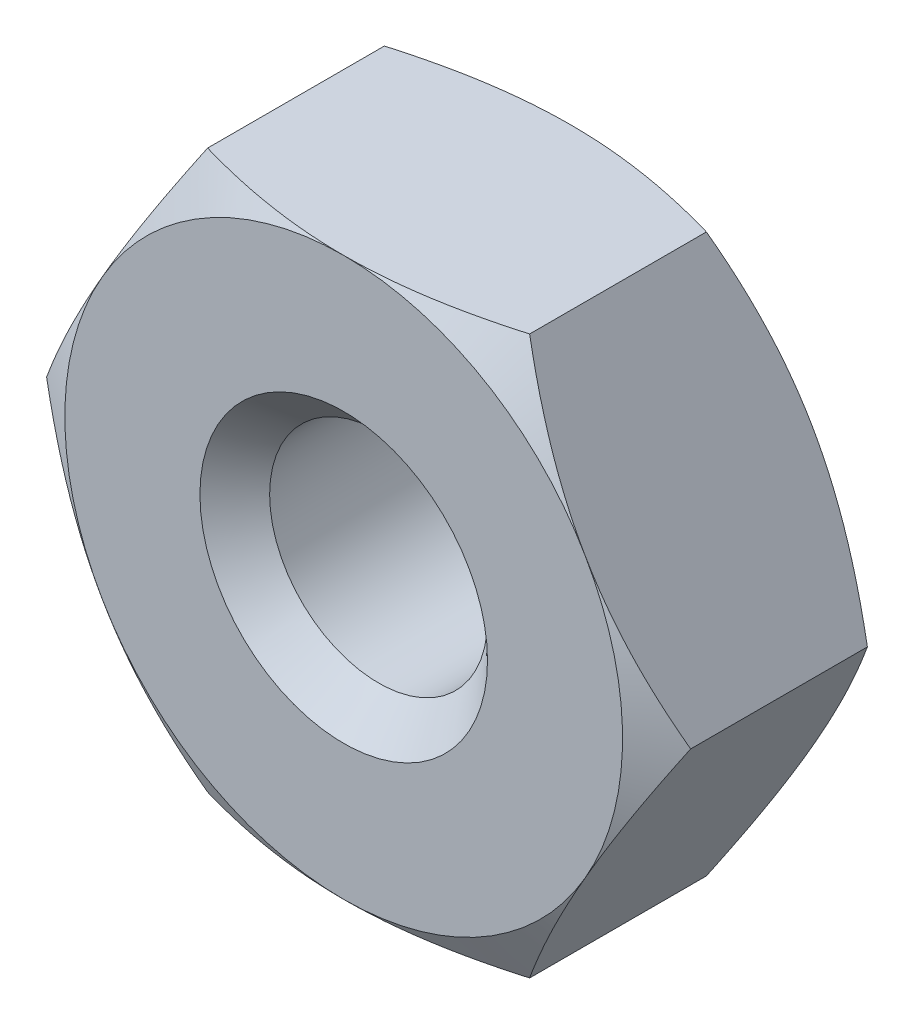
ISO-10303-21;
HEADER;
FILE_DESCRIPTION(('STEP AP214'),'2;1');
FILE_NAME('part.step','',(''),(''),'','','');
FILE_SCHEMA(('AUTOMOTIVE_DESIGN { 1 0 10303 214 1 1 1 1 }'));
ENDSEC;
DATA;
#1=APPLICATION_CONTEXT('core data for automotive mechanical design processes');
#2=APPLICATION_PROTOCOL_DEFINITION('international standard','automotive_design',2000,#1);
#3=PRODUCT_CONTEXT('',#1,'mechanical');
#4=PRODUCT('Part','Part','',(#3));
#5=PRODUCT_RELATED_PRODUCT_CATEGORY('part','',(#4));
#6=PRODUCT_DEFINITION_FORMATION('','',#4);
#7=PRODUCT_DEFINITION_CONTEXT('part definition',#1,'design');
#8=PRODUCT_DEFINITION('design','',#6,#7);
#9=PRODUCT_DEFINITION_SHAPE('','',#8);
#10=(LENGTH_UNIT() NAMED_UNIT(*) SI_UNIT(.MILLI.,.METRE.));
#11=(NAMED_UNIT(*) PLANE_ANGLE_UNIT() SI_UNIT($,.RADIAN.));
#12=(NAMED_UNIT(*) SI_UNIT($,.STERADIAN.) SOLID_ANGLE_UNIT());
#13=UNCERTAINTY_MEASURE_WITH_UNIT(LENGTH_MEASURE(1.E-05),#10,'distance_accuracy_value','');
#14=(GEOMETRIC_REPRESENTATION_CONTEXT(3) GLOBAL_UNCERTAINTY_ASSIGNED_CONTEXT((#13)) GLOBAL_UNIT_ASSIGNED_CONTEXT((#10,
#11,#12)) REPRESENTATION_CONTEXT('',''));
#15=CARTESIAN_POINT('',(0.,0.,0.));
#16=DIRECTION('',(0.,0.,1.));
#17=DIRECTION('',(1.,0.,0.));
#18=AXIS2_PLACEMENT_3D('',#15,#16,#17);
#19=CARTESIAN_POINT('',(1.8475208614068,0.,0.65));
#20=DIRECTION('',(-0.866025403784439,-0.5,0.));
#21=DIRECTION('',(0.5,-0.866025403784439,0.));
#22=AXIS2_PLACEMENT_3D('',#19,#20,#21);
#23=PLANE('',#22);
#24=DIRECTION('',(0.,0.,-1.));
#25=VECTOR('',#24,1.);
#26=CARTESIAN_POINT('',(1.8475208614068,0.,0.65));
#27=LINE('',#26,#25);
#28=CARTESIAN_POINT('',(1.8475208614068,0.,0.507093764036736));
#29=VERTEX_POINT('',#28);
#30=CARTESIAN_POINT('',(1.8475208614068,0.,-0.507093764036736));
#31=VERTEX_POINT('',#30);
#32=EDGE_CURVE('E157',#29,#31,#27,.T.);
#33=ORIENTED_EDGE('',*,*,#32,.T.);
#34=CARTESIAN_POINT('',(1.84763633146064,-0.000199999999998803,-0.50702709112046));
#35=CARTESIAN_POINT('',(1.8070407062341,0.0701136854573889,-0.530476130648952));
#36=CARTESIAN_POINT('',(1.76609466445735,0.14103431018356,-0.551802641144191));
#37=CARTESIAN_POINT('',(1.68349346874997,0.284103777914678,-0.589029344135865));
#38=CARTESIAN_POINT('',(1.64183684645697,0.356255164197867,-0.604916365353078));
#39=CARTESIAN_POINT('',(1.55903989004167,0.499663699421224,-0.629648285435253));
#40=CARTESIAN_POINT('',(1.51791229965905,0.570898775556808,-0.63865776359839));
#41=CARTESIAN_POINT('',(1.43546347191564,0.713704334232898,-0.649415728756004));
#42=CARTESIAN_POINT('',(1.3941425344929,0.785274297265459,-0.651173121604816));
#43=CARTESIAN_POINT('',(1.31692357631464,0.919021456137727,-0.647528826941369));
#44=CARTESIAN_POINT('',(1.28101403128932,0.981218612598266,-0.64302194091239));
#45=CARTESIAN_POINT('',(1.20942890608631,1.10520768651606,-0.628734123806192));
#46=CARTESIAN_POINT('',(1.1737535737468,1.166999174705,-0.618948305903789));
#47=CARTESIAN_POINT('',(1.10202069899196,1.29124415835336,-0.594483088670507));
#48=CARTESIAN_POINT('',(1.06597224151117,1.35368191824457,-0.579699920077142));
#49=CARTESIAN_POINT('',(0.994413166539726,1.47762587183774,-0.546147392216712));
#50=CARTESIAN_POINT('',(0.958901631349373,1.5391336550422,-0.527385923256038));
#51=CARTESIAN_POINT('',(0.923644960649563,1.6002,-0.50702709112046));
#52=B_SPLINE_CURVE_WITH_KNOTS('',3,(#34,#35,#36,#37,#38,#39,#40,#41,#42,#43,#44,#45,#46,#47,#48,
#49,#50,#51),.UNSPECIFIED.,.F.,.F.,(4,2,2,2,2,2,2,2,4),(0.,0.25362862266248,0.507867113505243,
0.755812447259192,1.00345320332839,1.21912891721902,1.43500463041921,1.65567058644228,
1.87590291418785),.UNSPECIFIED.);
#53=CARTESIAN_POINT('',(1.3856406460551,0.800000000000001,-0.65));
#54=VERTEX_POINT('',#53);
#55=EDGE_CURVE('E62',#31,#54,#52,.T.);
#56=ORIENTED_EDGE('',*,*,#55,.T.);
#57=CARTESIAN_POINT('',(0.923760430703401,1.6,-0.507093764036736));
#58=VERTEX_POINT('',#57);
#59=EDGE_CURVE('E130',#54,#58,#52,.T.);
#60=ORIENTED_EDGE('',*,*,#59,.T.);
#61=DIRECTION('',(0.,0.,-1.));
#62=VECTOR('',#61,1.);
#63=CARTESIAN_POINT('',(0.923760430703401,1.6,0.65));
#64=LINE('',#63,#62);
#65=CARTESIAN_POINT('',(0.923760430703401,1.6,0.507093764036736));
#66=VERTEX_POINT('',#65);
#67=EDGE_CURVE('E274',#66,#58,#64,.T.);
#68=ORIENTED_EDGE('',*,*,#67,.F.);
#69=CARTESIAN_POINT('',(1.84763633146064,-0.000199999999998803,0.50702709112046));
#70=CARTESIAN_POINT('',(1.8070407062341,0.0701136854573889,0.530476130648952));
#71=CARTESIAN_POINT('',(1.76609466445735,0.14103431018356,0.551802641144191));
#72=CARTESIAN_POINT('',(1.68349346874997,0.284103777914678,0.589029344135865));
#73=CARTESIAN_POINT('',(1.64183684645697,0.356255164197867,0.604916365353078));
#74=CARTESIAN_POINT('',(1.55903989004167,0.499663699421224,0.629648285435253));
#75=CARTESIAN_POINT('',(1.51791229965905,0.570898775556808,0.63865776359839));
#76=CARTESIAN_POINT('',(1.43546347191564,0.713704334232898,0.649415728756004));
#77=CARTESIAN_POINT('',(1.3941425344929,0.785274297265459,0.651173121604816));
#78=CARTESIAN_POINT('',(1.31692357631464,0.919021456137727,0.647528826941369));
#79=CARTESIAN_POINT('',(1.28101403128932,0.981218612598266,0.64302194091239));
#80=CARTESIAN_POINT('',(1.20942890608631,1.10520768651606,0.628734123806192));
#81=CARTESIAN_POINT('',(1.1737535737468,1.166999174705,0.618948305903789));
#82=CARTESIAN_POINT('',(1.10202069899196,1.29124415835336,0.594483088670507));
#83=CARTESIAN_POINT('',(1.06597224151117,1.35368191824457,0.579699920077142));
#84=CARTESIAN_POINT('',(0.994413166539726,1.47762587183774,0.546147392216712));
#85=CARTESIAN_POINT('',(0.958901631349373,1.5391336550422,0.527385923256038));
#86=CARTESIAN_POINT('',(0.923644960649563,1.6002,0.50702709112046));
#87=B_SPLINE_CURVE_WITH_KNOTS('',3,(#69,#70,#71,#72,#73,#74,#75,#76,#77,#78,#79,#80,#81,#82,#83,
#84,#85,#86),.UNSPECIFIED.,.F.,.F.,(4,2,2,2,2,2,2,2,4),(0.,0.25362862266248,0.507867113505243,
0.755812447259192,1.00345320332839,1.21912891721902,1.43500463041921,1.65567058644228,
1.87590291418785),.UNSPECIFIED.);
#88=CARTESIAN_POINT('',(1.3856406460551,0.800000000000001,0.65));
#89=VERTEX_POINT('',#88);
#90=EDGE_CURVE('E254',#89,#66,#87,.T.);
#91=ORIENTED_EDGE('',*,*,#90,.F.);
#92=EDGE_CURVE('E260',#29,#89,#87,.T.);
#93=ORIENTED_EDGE('',*,*,#92,.F.);
#94=EDGE_LOOP('',(#33,#56,#60,#68,#91,#93));
#95=FACE_BOUND('',#94,.T.);
#96=ADVANCED_FACE('F40',(#95),#23,.F.);
#97=CARTESIAN_POINT('',(0.923760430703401,1.6,0.65));
#98=DIRECTION('',(0.,-1.,0.));
#99=DIRECTION('',(1.,0.,0.));
#100=AXIS2_PLACEMENT_3D('',#97,#98,#99);
#101=PLANE('',#100);
#102=ORIENTED_EDGE('',*,*,#67,.T.);
#103=CARTESIAN_POINT('',(-2.51916788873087,1.6,0.149241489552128));
#104=CARTESIAN_POINT('',(-2.44895042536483,1.6,0.115029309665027));
#105=CARTESIAN_POINT('',(-2.37857576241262,1.6,0.0811344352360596));
#106=CARTESIAN_POINT('',(-2.23742856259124,1.6,0.0141570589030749));
#107=CARTESIAN_POINT('',(-2.16665596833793,1.6,-0.0189253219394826));
#108=CARTESIAN_POINT('',(-2.02428271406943,1.6,-0.0842583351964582));
#109=CARTESIAN_POINT('',(-1.9526796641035,1.6,-0.116503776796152));
#110=CARTESIAN_POINT('',(-1.80891704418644,1.6,-0.179724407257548));
#111=CARTESIAN_POINT('',(-1.73675749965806,1.6,-0.210699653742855));
#112=CARTESIAN_POINT('',(-1.58930781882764,1.6,-0.272069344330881));
#113=CARTESIAN_POINT('',(-1.51399452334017,1.6,-0.302408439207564));
#114=CARTESIAN_POINT('',(-1.3625157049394,1.6,-0.360874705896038));
#115=CARTESIAN_POINT('',(-1.28635025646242,1.6,-0.389002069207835));
#116=CARTESIAN_POINT('',(-1.13315458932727,1.6,-0.442343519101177));
#117=CARTESIAN_POINT('',(-1.05612623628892,1.6,-0.467562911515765));
#118=CARTESIAN_POINT('',(-0.900965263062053,1.6,-0.514301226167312));
#119=CARTESIAN_POINT('',(-0.822832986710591,1.6,-0.535821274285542));
#120=CARTESIAN_POINT('',(-0.665851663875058,1.6,-0.574039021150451));
#121=CARTESIAN_POINT('',(-0.587009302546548,1.6,-0.590763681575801));
#122=CARTESIAN_POINT('',(-0.428306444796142,1.6,-0.618470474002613));
#123=CARTESIAN_POINT('',(-0.348446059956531,1.6,-0.629453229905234));
#124=CARTESIAN_POINT('',(-0.189161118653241,1.6,-0.644655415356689));
#125=CARTESIAN_POINT('',(-0.109745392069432,1.6,-0.648964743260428));
#126=CARTESIAN_POINT('',(0.0491604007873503,1.6,-0.65070416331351));
#127=CARTESIAN_POINT('',(0.128650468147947,1.6,-0.64813415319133));
#128=CARTESIAN_POINT('',(0.317105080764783,1.6,-0.634104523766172));
#129=CARTESIAN_POINT('',(0.425848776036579,1.6,-0.619650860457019));
#130=CARTESIAN_POINT('',(0.641428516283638,1.6,-0.58030051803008));
#131=CARTESIAN_POINT('',(0.748262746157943,1.6,-0.555394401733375));
#132=CARTESIAN_POINT('',(0.962270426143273,1.6,-0.497218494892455));
#133=CARTESIAN_POINT('',(1.06939295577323,1.6,-0.463766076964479));
#134=CARTESIAN_POINT('',(1.22857401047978,1.6,-0.409346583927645));
#135=CARTESIAN_POINT('',(1.28138000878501,1.6,-0.390501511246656));
#136=CARTESIAN_POINT('',(1.38655102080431,1.6,-0.351618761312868));
#137=CARTESIAN_POINT('',(1.43891604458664,1.6,-0.331581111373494));
#138=CARTESIAN_POINT('',(1.57984093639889,1.6,-0.276112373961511));
#139=CARTESIAN_POINT('',(1.66802977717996,1.6,-0.239740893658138));
#140=CARTESIAN_POINT('',(1.84349850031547,1.6,-0.164859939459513));
#141=CARTESIAN_POINT('',(1.93077828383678,1.6,-0.126350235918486));
#142=CARTESIAN_POINT('',(2.10463493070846,1.6,-0.0477012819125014));
#143=CARTESIAN_POINT('',(2.19121153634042,1.6,-0.00756146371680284));
#144=CARTESIAN_POINT('',(2.36377704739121,1.6,0.0739645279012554));
#145=CARTESIAN_POINT('',(2.44976593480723,1.6,0.115350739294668));
#146=CARTESIAN_POINT('',(2.70729585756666,1.6,0.24108400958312));
#147=CARTESIAN_POINT('',(2.87812831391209,1.6,0.32688046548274));
#148=CARTESIAN_POINT('',(3.21850139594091,1.6,0.500892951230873));
#149=CARTESIAN_POINT('',(3.38804228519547,1.6,0.589108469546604));
#150=CARTESIAN_POINT('',(3.70835206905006,1.6,0.757765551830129));
#151=CARTESIAN_POINT('',(3.85920829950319,1.6,0.838041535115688));
#152=CARTESIAN_POINT('',(4.1604136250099,1.6,0.999559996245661));
#153=CARTESIAN_POINT('',(4.31076268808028,1.6,1.08080253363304));
#154=CARTESIAN_POINT('',(4.61056605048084,1.6,1.24373004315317));
#155=CARTESIAN_POINT('',(4.7600216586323,1.6,1.32541260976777));
#156=CARTESIAN_POINT('',(5.0586161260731,1.6,1.48932694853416));
#157=CARTESIAN_POINT('',(5.20775500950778,1.6,1.57155867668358));
#158=CARTESIAN_POINT('',(5.35678266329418,1.6,1.65399010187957));
#159=B_SPLINE_CURVE_WITH_KNOTS('',3,(#103,#104,#105,#106,#107,#108,#109,#110,#111,#112,#113,
#114,#115,#116,#117,#118,#119,#120,#121,#122,#123,#124,#125,#126,#127,#128,#129,#130,#131,#132,
#133,#134,#135,#136,#137,#138,#139,#140,#141,#142,#143,#144,#145,#146,#147,#148,#149,#150,#151,
#152,#153,#154,#155,#156,#157,#158),.UNSPECIFIED.,.F.,.F.,(4,2,2,2,2,2,2,2,2,2,2,2,2,2,2,2,2,2,
2,2,2,2,2,2,2,2,2,4),(0.,0.234328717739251,0.468692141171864,0.704268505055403,
0.939834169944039,1.18339104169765,1.42692680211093,1.67001093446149,1.91302095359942,
2.15463660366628,2.39622599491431,2.63453169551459,2.87284093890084,3.20126487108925,
3.52998596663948,3.86642448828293,4.03461857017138,4.20280880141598,4.48895182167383,
4.77512563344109,5.06139998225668,5.34768306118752,5.92114688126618,6.49449035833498,
7.00714188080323,7.51982514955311,8.03078489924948,8.54170418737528),.UNSPECIFIED.);
#160=CARTESIAN_POINT('',(0.,1.6,-0.65));
#161=VERTEX_POINT('',#160);
#162=EDGE_CURVE('E136',#58,#161,#159,.F.);
#163=ORIENTED_EDGE('',*,*,#162,.T.);
#164=CARTESIAN_POINT('',(-0.923760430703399,1.6,-0.507093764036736));
#165=VERTEX_POINT('',#164);
#166=EDGE_CURVE('E169',#161,#165,#159,.F.);
#167=ORIENTED_EDGE('',*,*,#166,.T.);
#168=DIRECTION('',(0.,0.,-1.));
#169=VECTOR('',#168,1.);
#170=CARTESIAN_POINT('',(-0.923760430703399,1.6,0.65));
#171=LINE('',#170,#169);
#172=CARTESIAN_POINT('',(-0.923760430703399,1.6,0.507093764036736));
#173=VERTEX_POINT('',#172);
#174=EDGE_CURVE('E271',#173,#165,#171,.T.);
#175=ORIENTED_EDGE('',*,*,#174,.F.);
#176=CARTESIAN_POINT('',(-2.51916788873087,1.6,-0.149241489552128));
#177=CARTESIAN_POINT('',(-2.44895042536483,1.6,-0.115029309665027));
#178=CARTESIAN_POINT('',(-2.37857576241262,1.6,-0.0811344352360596));
#179=CARTESIAN_POINT('',(-2.23742856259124,1.6,-0.0141570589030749));
#180=CARTESIAN_POINT('',(-2.16665596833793,1.6,0.0189253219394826));
#181=CARTESIAN_POINT('',(-2.02428271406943,1.6,0.0842583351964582));
#182=CARTESIAN_POINT('',(-1.9526796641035,1.6,0.116503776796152));
#183=CARTESIAN_POINT('',(-1.80891704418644,1.6,0.179724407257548));
#184=CARTESIAN_POINT('',(-1.73675749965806,1.6,0.210699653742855));
#185=CARTESIAN_POINT('',(-1.58930781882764,1.6,0.272069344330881));
#186=CARTESIAN_POINT('',(-1.51399452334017,1.6,0.302408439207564));
#187=CARTESIAN_POINT('',(-1.3625157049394,1.6,0.360874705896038));
#188=CARTESIAN_POINT('',(-1.28635025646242,1.6,0.389002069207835));
#189=CARTESIAN_POINT('',(-1.13315458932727,1.6,0.442343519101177));
#190=CARTESIAN_POINT('',(-1.05612623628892,1.6,0.467562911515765));
#191=CARTESIAN_POINT('',(-0.900965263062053,1.6,0.514301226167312));
#192=CARTESIAN_POINT('',(-0.822832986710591,1.6,0.535821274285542));
#193=CARTESIAN_POINT('',(-0.665851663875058,1.6,0.574039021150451));
#194=CARTESIAN_POINT('',(-0.587009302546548,1.6,0.590763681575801));
#195=CARTESIAN_POINT('',(-0.428306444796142,1.6,0.618470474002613));
#196=CARTESIAN_POINT('',(-0.348446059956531,1.6,0.629453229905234));
#197=CARTESIAN_POINT('',(-0.189161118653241,1.6,0.644655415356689));
#198=CARTESIAN_POINT('',(-0.109745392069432,1.6,0.648964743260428));
#199=CARTESIAN_POINT('',(0.0491604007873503,1.6,0.65070416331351));
#200=CARTESIAN_POINT('',(0.128650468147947,1.6,0.64813415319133));
#201=CARTESIAN_POINT('',(0.317105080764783,1.6,0.634104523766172));
#202=CARTESIAN_POINT('',(0.425848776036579,1.6,0.619650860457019));
#203=CARTESIAN_POINT('',(0.641428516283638,1.6,0.58030051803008));
#204=CARTESIAN_POINT('',(0.748262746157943,1.6,0.555394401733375));
#205=CARTESIAN_POINT('',(0.962270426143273,1.6,0.497218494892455));
#206=CARTESIAN_POINT('',(1.06939295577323,1.6,0.463766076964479));
#207=CARTESIAN_POINT('',(1.22857401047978,1.6,0.409346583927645));
#208=CARTESIAN_POINT('',(1.28138000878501,1.6,0.390501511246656));
#209=CARTESIAN_POINT('',(1.38655102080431,1.6,0.351618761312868));
#210=CARTESIAN_POINT('',(1.43891604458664,1.6,0.331581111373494));
#211=CARTESIAN_POINT('',(1.57984093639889,1.6,0.276112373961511));
#212=CARTESIAN_POINT('',(1.66802977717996,1.6,0.239740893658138));
#213=CARTESIAN_POINT('',(1.84349850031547,1.6,0.164859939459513));
#214=CARTESIAN_POINT('',(1.93077828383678,1.6,0.126350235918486));
#215=CARTESIAN_POINT('',(2.10463493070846,1.6,0.0477012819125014));
#216=CARTESIAN_POINT('',(2.19121153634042,1.6,0.00756146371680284));
#217=CARTESIAN_POINT('',(2.36377704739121,1.6,-0.0739645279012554));
#218=CARTESIAN_POINT('',(2.44976593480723,1.6,-0.115350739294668));
#219=CARTESIAN_POINT('',(2.70729585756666,1.6,-0.24108400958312));
#220=CARTESIAN_POINT('',(2.87812831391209,1.6,-0.32688046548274));
#221=CARTESIAN_POINT('',(3.21850139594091,1.6,-0.500892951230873));
#222=CARTESIAN_POINT('',(3.38804228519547,1.6,-0.589108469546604));
#223=CARTESIAN_POINT('',(3.70835206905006,1.6,-0.757765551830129));
#224=CARTESIAN_POINT('',(3.85920829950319,1.6,-0.838041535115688));
#225=CARTESIAN_POINT('',(4.1604136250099,1.6,-0.999559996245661));
#226=CARTESIAN_POINT('',(4.31076268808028,1.6,-1.08080253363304));
#227=CARTESIAN_POINT('',(4.61056605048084,1.6,-1.24373004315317));
#228=CARTESIAN_POINT('',(4.7600216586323,1.6,-1.32541260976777));
#229=CARTESIAN_POINT('',(5.0586161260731,1.6,-1.48932694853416));
#230=CARTESIAN_POINT('',(5.20775500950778,1.6,-1.57155867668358));
#231=CARTESIAN_POINT('',(5.35678266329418,1.6,-1.65399010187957));
#232=B_SPLINE_CURVE_WITH_KNOTS('',3,(#176,#177,#178,#179,#180,#181,#182,#183,#184,#185,#186,
#187,#188,#189,#190,#191,#192,#193,#194,#195,#196,#197,#198,#199,#200,#201,#202,#203,#204,#205,
#206,#207,#208,#209,#210,#211,#212,#213,#214,#215,#216,#217,#218,#219,#220,#221,#222,#223,#224,
#225,#226,#227,#228,#229,#230,#231),.UNSPECIFIED.,.F.,.F.,(4,2,2,2,2,2,2,2,2,2,2,2,2,2,2,2,2,2,
2,2,2,2,2,2,2,2,2,4),(0.,0.234328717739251,0.468692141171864,0.704268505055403,
0.939834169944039,1.18339104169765,1.42692680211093,1.67001093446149,1.91302095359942,
2.15463660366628,2.39622599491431,2.63453169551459,2.87284093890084,3.20126487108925,
3.52998596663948,3.86642448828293,4.03461857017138,4.20280880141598,4.48895182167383,
4.77512563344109,5.06139998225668,5.34768306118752,5.92114688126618,6.49449035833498,
7.00714188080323,7.51982514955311,8.03078489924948,8.54170418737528),.UNSPECIFIED.);
#233=CARTESIAN_POINT('',(0.,1.6,0.65));
#234=VERTEX_POINT('',#233);
#235=EDGE_CURVE('E247',#234,#173,#232,.F.);
#236=ORIENTED_EDGE('',*,*,#235,.F.);
#237=EDGE_CURVE('E253',#66,#234,#232,.F.);
#238=ORIENTED_EDGE('',*,*,#237,.F.);
#239=EDGE_LOOP('',(#102,#163,#167,#175,#236,#238));
#240=FACE_BOUND('',#239,.T.);
#241=ADVANCED_FACE('F226',(#240),#101,.F.);
#242=CARTESIAN_POINT('',(-0.923760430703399,1.6,0.65));
#243=DIRECTION('',(0.866025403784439,-0.5,0.));
#244=DIRECTION('',(0.5,0.866025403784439,0.));
#245=AXIS2_PLACEMENT_3D('',#242,#243,#244);
#246=PLANE('',#245);
#247=ORIENTED_EDGE('',*,*,#174,.T.);
#248=CARTESIAN_POINT('',(-0.923644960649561,1.6002,-0.50702709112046));
#249=CARTESIAN_POINT('',(-0.964240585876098,1.52988631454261,-0.530476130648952));
#250=CARTESIAN_POINT('',(-1.00518662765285,1.45896568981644,-0.551802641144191));
#251=CARTESIAN_POINT('',(-1.08778782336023,1.31589622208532,-0.589029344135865));
#252=CARTESIAN_POINT('',(-1.12944444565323,1.24374483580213,-0.604916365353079));
#253=CARTESIAN_POINT('',(-1.21224140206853,1.10033630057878,-0.629648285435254));
#254=CARTESIAN_POINT('',(-1.25336899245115,1.02910122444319,-0.638657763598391));
#255=CARTESIAN_POINT('',(-1.33581782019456,0.886295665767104,-0.649415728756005));
#256=CARTESIAN_POINT('',(-1.37713875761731,0.814725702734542,-0.651173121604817));
#257=CARTESIAN_POINT('',(-1.45435771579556,0.680978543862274,-0.64752882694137));
#258=CARTESIAN_POINT('',(-1.49026726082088,0.618781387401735,-0.643021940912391));
#259=CARTESIAN_POINT('',(-1.56185238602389,0.494792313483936,-0.628734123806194));
#260=CARTESIAN_POINT('',(-1.5975277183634,0.433000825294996,-0.61894830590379));
#261=CARTESIAN_POINT('',(-1.66926059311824,0.30875584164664,-0.594483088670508));
#262=CARTESIAN_POINT('',(-1.70530905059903,0.246318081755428,-0.579699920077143));
#263=CARTESIAN_POINT('',(-1.77686812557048,0.122374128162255,-0.546147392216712));
#264=CARTESIAN_POINT('',(-1.81237966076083,0.0608663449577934,-0.527385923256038));
#265=CARTESIAN_POINT('',(-1.84763633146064,-0.000200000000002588,-0.50702709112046));
#266=B_SPLINE_CURVE_WITH_KNOTS('',3,(#248,#249,#250,#251,#252,#253,#254,#255,#256,#257,#258,
#259,#260,#261,#262,#263,#264,#265),.UNSPECIFIED.,.F.,.F.,(4,2,2,2,2,2,2,2,4),(0.,
0.25362862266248,0.507867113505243,0.755812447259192,1.00345320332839,1.21912891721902,
1.43500463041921,1.65567058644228,1.87590291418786),.UNSPECIFIED.);
#267=CARTESIAN_POINT('',(-1.3856406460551,0.8,-0.65));
#268=VERTEX_POINT('',#267);
#269=EDGE_CURVE('E220',#165,#268,#266,.T.);
#270=ORIENTED_EDGE('',*,*,#269,.T.);
#271=CARTESIAN_POINT('',(-1.8475208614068,0.,-0.507093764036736));
#272=VERTEX_POINT('',#271);
#273=EDGE_CURVE('E213',#268,#272,#266,.T.);
#274=ORIENTED_EDGE('',*,*,#273,.T.);
#275=DIRECTION('',(0.,0.,-1.));
#276=VECTOR('',#275,1.);
#277=CARTESIAN_POINT('',(-1.8475208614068,0.,0.65));
#278=LINE('',#277,#276);
#279=CARTESIAN_POINT('',(-1.8475208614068,0.,0.507093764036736));
#280=VERTEX_POINT('',#279);
#281=EDGE_CURVE('E268',#280,#272,#278,.T.);
#282=ORIENTED_EDGE('',*,*,#281,.F.);
#283=CARTESIAN_POINT('',(-0.923644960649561,1.6002,0.50702709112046));
#284=CARTESIAN_POINT('',(-0.964240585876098,1.52988631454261,0.530476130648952));
#285=CARTESIAN_POINT('',(-1.00518662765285,1.45896568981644,0.551802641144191));
#286=CARTESIAN_POINT('',(-1.08778782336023,1.31589622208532,0.589029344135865));
#287=CARTESIAN_POINT('',(-1.12944444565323,1.24374483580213,0.604916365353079));
#288=CARTESIAN_POINT('',(-1.21224140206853,1.10033630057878,0.629648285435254));
#289=CARTESIAN_POINT('',(-1.25336899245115,1.02910122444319,0.638657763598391));
#290=CARTESIAN_POINT('',(-1.33581782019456,0.886295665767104,0.649415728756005));
#291=CARTESIAN_POINT('',(-1.37713875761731,0.814725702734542,0.651173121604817));
#292=CARTESIAN_POINT('',(-1.45435771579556,0.680978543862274,0.64752882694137));
#293=CARTESIAN_POINT('',(-1.49026726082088,0.618781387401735,0.643021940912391));
#294=CARTESIAN_POINT('',(-1.56185238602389,0.494792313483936,0.628734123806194));
#295=CARTESIAN_POINT('',(-1.5975277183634,0.433000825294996,0.61894830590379));
#296=CARTESIAN_POINT('',(-1.66926059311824,0.30875584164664,0.594483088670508));
#297=CARTESIAN_POINT('',(-1.70530905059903,0.246318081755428,0.579699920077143));
#298=CARTESIAN_POINT('',(-1.77686812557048,0.122374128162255,0.546147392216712));
#299=CARTESIAN_POINT('',(-1.81237966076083,0.0608663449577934,0.527385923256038));
#300=CARTESIAN_POINT('',(-1.84763633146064,-0.000200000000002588,0.50702709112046));
#301=B_SPLINE_CURVE_WITH_KNOTS('',3,(#283,#284,#285,#286,#287,#288,#289,#290,#291,#292,#293,
#294,#295,#296,#297,#298,#299,#300),.UNSPECIFIED.,.F.,.F.,(4,2,2,2,2,2,2,2,4),(0.,
0.25362862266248,0.507867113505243,0.755812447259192,1.00345320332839,1.21912891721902,
1.43500463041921,1.65567058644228,1.87590291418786),.UNSPECIFIED.);
#302=CARTESIAN_POINT('',(-1.3856406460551,0.8,0.65));
#303=VERTEX_POINT('',#302);
#304=EDGE_CURVE('E232',#303,#280,#301,.T.);
#305=ORIENTED_EDGE('',*,*,#304,.F.);
#306=EDGE_CURVE('E239',#173,#303,#301,.T.);
#307=ORIENTED_EDGE('',*,*,#306,.F.);
#308=EDGE_LOOP('',(#247,#270,#274,#282,#305,#307));
#309=FACE_BOUND('',#308,.T.);
#310=ADVANCED_FACE('F222',(#309),#246,.F.);
#311=CARTESIAN_POINT('',(-1.8475208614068,0.,0.65));
#312=DIRECTION('',(0.866025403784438,0.5,0.));
#313=DIRECTION('',(-0.5,0.866025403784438,0.));
#314=AXIS2_PLACEMENT_3D('',#311,#312,#313);
#315=PLANE('',#314);
#316=ORIENTED_EDGE('',*,*,#281,.T.);
#317=CARTESIAN_POINT('',(-1.84763633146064,0.000199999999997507,-0.50702709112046));
#318=CARTESIAN_POINT('',(-1.8070407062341,-0.0701136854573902,-0.530476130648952));
#319=CARTESIAN_POINT('',(-1.76609466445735,-0.141034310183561,-0.551802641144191));
#320=CARTESIAN_POINT('',(-1.68349346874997,-0.28410377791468,-0.589029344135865));
#321=CARTESIAN_POINT('',(-1.64183684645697,-0.356255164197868,-0.604916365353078));
#322=CARTESIAN_POINT('',(-1.55903989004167,-0.499663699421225,-0.629648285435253));
#323=CARTESIAN_POINT('',(-1.51791229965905,-0.570898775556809,-0.63865776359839));
#324=CARTESIAN_POINT('',(-1.43546347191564,-0.713704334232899,-0.649415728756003));
#325=CARTESIAN_POINT('',(-1.39414253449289,-0.785274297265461,-0.651173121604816));
#326=CARTESIAN_POINT('',(-1.31692357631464,-0.919021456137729,-0.647528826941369));
#327=CARTESIAN_POINT('',(-1.28101403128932,-0.981218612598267,-0.643021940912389));
#328=CARTESIAN_POINT('',(-1.20942890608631,-1.10520768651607,-0.628734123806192));
#329=CARTESIAN_POINT('',(-1.1737535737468,-1.16699917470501,-0.618948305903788));
#330=CARTESIAN_POINT('',(-1.10202069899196,-1.29124415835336,-0.594483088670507));
#331=CARTESIAN_POINT('',(-1.06597224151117,-1.35368191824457,-0.579699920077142));
#332=CARTESIAN_POINT('',(-0.994413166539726,-1.47762587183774,-0.546147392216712));
#333=CARTESIAN_POINT('',(-0.958901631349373,-1.5391336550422,-0.527385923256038));
#334=CARTESIAN_POINT('',(-0.923644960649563,-1.6002,-0.50702709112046));
#335=B_SPLINE_CURVE_WITH_KNOTS('',3,(#317,#318,#319,#320,#321,#322,#323,#324,#325,#326,#327,
#328,#329,#330,#331,#332,#333,#334),.UNSPECIFIED.,.F.,.F.,(4,2,2,2,2,2,2,2,4),(0.,
0.25362862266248,0.507867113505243,0.755812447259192,1.00345320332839,1.21912891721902,
1.43500463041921,1.65567058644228,1.87590291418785),.UNSPECIFIED.);
#336=CARTESIAN_POINT('',(-1.3856406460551,-0.800000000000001,-0.65));
#337=VERTEX_POINT('',#336);
#338=EDGE_CURVE('E221',#272,#337,#335,.T.);
#339=ORIENTED_EDGE('',*,*,#338,.T.);
#340=CARTESIAN_POINT('',(-0.923760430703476,-1.6,-0.507093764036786));
#341=VERTEX_POINT('',#340);
#342=EDGE_CURVE('E207',#337,#341,#335,.T.);
#343=ORIENTED_EDGE('',*,*,#342,.T.);
#344=DIRECTION('',(0.,0.,-1.));
#345=VECTOR('',#344,1.);
#346=CARTESIAN_POINT('',(-0.923760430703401,-1.6,0.65));
#347=LINE('',#346,#345);
#348=CARTESIAN_POINT('',(-0.923760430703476,-1.6,0.507093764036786));
#349=VERTEX_POINT('',#348);
#350=EDGE_CURVE('E265',#349,#341,#347,.T.);
#351=ORIENTED_EDGE('',*,*,#350,.F.);
#352=CARTESIAN_POINT('',(-1.84763633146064,0.000199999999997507,0.50702709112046));
#353=CARTESIAN_POINT('',(-1.8070407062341,-0.0701136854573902,0.530476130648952));
#354=CARTESIAN_POINT('',(-1.76609466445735,-0.141034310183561,0.551802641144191));
#355=CARTESIAN_POINT('',(-1.68349346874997,-0.28410377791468,0.589029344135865));
#356=CARTESIAN_POINT('',(-1.64183684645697,-0.356255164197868,0.604916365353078));
#357=CARTESIAN_POINT('',(-1.55903989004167,-0.499663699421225,0.629648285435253));
#358=CARTESIAN_POINT('',(-1.51791229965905,-0.570898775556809,0.63865776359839));
#359=CARTESIAN_POINT('',(-1.43546347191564,-0.713704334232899,0.649415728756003));
#360=CARTESIAN_POINT('',(-1.39414253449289,-0.785274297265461,0.651173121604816));
#361=CARTESIAN_POINT('',(-1.31692357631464,-0.919021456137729,0.647528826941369));
#362=CARTESIAN_POINT('',(-1.28101403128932,-0.981218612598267,0.643021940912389));
#363=CARTESIAN_POINT('',(-1.20942890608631,-1.10520768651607,0.628734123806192));
#364=CARTESIAN_POINT('',(-1.1737535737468,-1.16699917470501,0.618948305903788));
#365=CARTESIAN_POINT('',(-1.10202069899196,-1.29124415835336,0.594483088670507));
#366=CARTESIAN_POINT('',(-1.06597224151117,-1.35368191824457,0.579699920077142));
#367=CARTESIAN_POINT('',(-0.994413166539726,-1.47762587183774,0.546147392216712));
#368=CARTESIAN_POINT('',(-0.958901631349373,-1.5391336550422,0.527385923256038));
#369=CARTESIAN_POINT('',(-0.923644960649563,-1.6002,0.50702709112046));
#370=B_SPLINE_CURVE_WITH_KNOTS('',3,(#352,#353,#354,#355,#356,#357,#358,#359,#360,#361,#362,
#363,#364,#365,#366,#367,#368,#369),.UNSPECIFIED.,.F.,.F.,(4,2,2,2,2,2,2,2,4),(0.,
0.25362862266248,0.507867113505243,0.755812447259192,1.00345320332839,1.21912891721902,
1.43500463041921,1.65567058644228,1.87590291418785),.UNSPECIFIED.);
#371=CARTESIAN_POINT('',(-1.3856406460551,-0.800000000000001,0.65));
#372=VERTEX_POINT('',#371);
#373=EDGE_CURVE('E241',#372,#349,#370,.T.);
#374=ORIENTED_EDGE('',*,*,#373,.F.);
#375=EDGE_CURVE('E240',#280,#372,#370,.T.);
#376=ORIENTED_EDGE('',*,*,#375,.F.);
#377=EDGE_LOOP('',(#316,#339,#343,#351,#374,#376));
#378=FACE_BOUND('',#377,.T.);
#379=ADVANCED_FACE('F225',(#378),#315,.F.);
#380=CARTESIAN_POINT('',(-0.923760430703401,-1.6,0.65));
#381=DIRECTION('',(0.,1.,0.));
#382=DIRECTION('',(0.,0.,1.));
#383=AXIS2_PLACEMENT_3D('',#380,#381,#382);
#384=PLANE('',#383);
#385=ORIENTED_EDGE('',*,*,#350,.T.);
#386=CARTESIAN_POINT('',(-2.51916788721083,-1.6,0.149241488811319));
#387=CARTESIAN_POINT('',(-2.44895042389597,-1.6,0.115029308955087));
#388=CARTESIAN_POINT('',(-2.37857576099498,-1.6,0.0811344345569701));
#389=CARTESIAN_POINT('',(-2.23742856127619,-1.6,0.0141570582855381));
#390=CARTESIAN_POINT('',(-2.16665596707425,-1.6,-0.0189253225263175));
#391=CARTESIAN_POINT('',(-2.02428271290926,-1.6,-0.0842583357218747));
#392=CARTESIAN_POINT('',(-1.95267966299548,-1.6,-0.116503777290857));
#393=CARTESIAN_POINT('',(-1.80891704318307,-1.6,-0.179724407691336));
#394=CARTESIAN_POINT('',(-1.73675749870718,-1.6,-0.210699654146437));
#395=CARTESIAN_POINT('',(-1.58930781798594,-1.6,-0.272069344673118));
#396=CARTESIAN_POINT('',(-1.51399452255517,-1.6,-0.302408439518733));
#397=CARTESIAN_POINT('',(-1.36251570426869,-1.6,-0.360874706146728));
#398=CARTESIAN_POINT('',(-1.28635025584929,-1.6,-0.389002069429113));
#399=CARTESIAN_POINT('',(-1.13315458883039,-1.6,-0.44234351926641));
#400=CARTESIAN_POINT('',(-1.05612623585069,-1.6,-0.467562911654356));
#401=CARTESIAN_POINT('',(-0.900965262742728,-1.6,-0.51430122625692));
#402=CARTESIAN_POINT('',(-0.822832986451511,-1.6,-0.535821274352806));
#403=CARTESIAN_POINT('',(-0.665851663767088,-1.6,-0.574039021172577));
#404=CARTESIAN_POINT('',(-0.58700930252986,-1.6,-0.590763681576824));
#405=CARTESIAN_POINT('',(-0.428306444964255,-1.6,-0.618470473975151));
#406=CARTESIAN_POINT('',(-0.34844606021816,-1.6,-0.629453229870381));
#407=CARTESIAN_POINT('',(-0.189161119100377,-1.6,-0.644655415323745));
#408=CARTESIAN_POINT('',(-0.10974539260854,-1.6,-0.648964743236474));
#409=CARTESIAN_POINT('',(0.0491604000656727,-1.6,-0.650704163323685));
#410=CARTESIAN_POINT('',(0.128650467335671,-1.6,-0.648134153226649));
#411=CARTESIAN_POINT('',(0.317105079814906,-1.6,-0.634104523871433));
#412=CARTESIAN_POINT('',(0.425848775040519,-1.6,-0.619650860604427));
#413=CARTESIAN_POINT('',(0.641428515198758,-1.6,-0.580300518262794));
#414=CARTESIAN_POINT('',(0.748262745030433,-1.6,-0.555394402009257));
#415=CARTESIAN_POINT('',(0.962270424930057,-1.6,-0.497218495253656));
#416=CARTESIAN_POINT('',(1.069392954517,-1.6,-0.463766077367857));
#417=CARTESIAN_POINT('',(1.22857400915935,-1.6,-0.40934658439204));
#418=CARTESIAN_POINT('',(1.28138000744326,-1.6,-0.390501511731));
#419=CARTESIAN_POINT('',(1.38655101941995,-1.6,-0.351618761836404));
#420=CARTESIAN_POINT('',(1.43891604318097,-1.6,-0.331581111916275));
#421=CARTESIAN_POINT('',(1.57984093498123,-1.6,-0.27611237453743));
#422=CARTESIAN_POINT('',(1.66802977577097,-1.6,-0.239740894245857));
#423=CARTESIAN_POINT('',(1.84349849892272,-1.6,-0.164859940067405));
#424=CARTESIAN_POINT('',(1.93077828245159,-1.6,-0.126350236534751));
#425=CARTESIAN_POINT('',(2.10463492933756,-1.6,-0.0477012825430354));
#426=CARTESIAN_POINT('',(2.19121153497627,-1.6,-0.00756146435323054));
#427=CARTESIAN_POINT('',(2.36377704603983,-1.6,0.0739645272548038));
#428=CARTESIAN_POINT('',(2.44976593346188,-1.6,0.115350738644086));
#429=CARTESIAN_POINT('',(2.70729585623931,-1.6,0.241084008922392));
#430=CARTESIAN_POINT('',(2.87812831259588,-1.6,0.326880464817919));
#431=CARTESIAN_POINT('',(3.21850139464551,-1.6,0.500892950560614));
#432=CARTESIAN_POINT('',(3.38804228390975,-1.6,0.589108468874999));
#433=CARTESIAN_POINT('',(3.70835206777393,-1.6,0.757765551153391));
#434=CARTESIAN_POINT('',(3.85920829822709,-1.6,0.838041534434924));
#435=CARTESIAN_POINT('',(4.16041362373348,-1.6,0.999559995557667));
#436=CARTESIAN_POINT('',(4.31076268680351,-1.6,1.08080253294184));
#437=CARTESIAN_POINT('',(4.61056604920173,-1.6,1.24373004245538));
#438=CARTESIAN_POINT('',(4.76002165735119,-1.6,1.32541260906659));
#439=CARTESIAN_POINT('',(5.05861612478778,-1.6,1.48932694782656));
#440=CARTESIAN_POINT('',(5.20775500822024,-1.6,1.57155867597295));
#441=CARTESIAN_POINT('',(5.35678266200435,-1.6,1.65399010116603));
#442=B_SPLINE_CURVE_WITH_KNOTS('',3,(#386,#387,#388,#389,#390,#391,#392,#393,#394,#395,#396,
#397,#398,#399,#400,#401,#402,#403,#404,#405,#406,#407,#408,#409,#410,#411,#412,#413,#414,#415,
#416,#417,#418,#419,#420,#421,#422,#423,#424,#425,#426,#427,#428,#429,#430,#431,#432,#433,#434,
#435,#436,#437,#438,#439,#440,#441),.UNSPECIFIED.,.F.,.F.,(4,2,2,2,2,2,2,2,2,2,2,2,2,2,2,2,2,2,
2,2,2,2,2,2,2,2,2,4),(0.,0.234328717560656,0.468692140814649,0.704268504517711,
0.939834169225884,1.18339104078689,1.42692680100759,1.67001093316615,1.91302095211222,
2.15463660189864,2.39622599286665,2.63453169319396,2.8728409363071,3.20126486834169,
3.52998596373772,3.86642448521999,4.03461856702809,4.20280879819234,4.48895181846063,
4.77512563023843,5.06139997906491,5.34768305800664,5.92114687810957,6.49449035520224,
7.00714187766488,7.51982514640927,8.03078489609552,8.54170418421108),.UNSPECIFIED.);
#443=CARTESIAN_POINT('',(0.,-1.6,-0.65));
#444=VERTEX_POINT('',#443);
#445=EDGE_CURVE('E376',#341,#444,#442,.T.);
#446=ORIENTED_EDGE('',*,*,#445,.T.);
#447=CARTESIAN_POINT('',(0.923760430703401,-1.6,-0.507093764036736));
#448=VERTEX_POINT('',#447);
#449=EDGE_CURVE('E200',#444,#448,#442,.T.);
#450=ORIENTED_EDGE('',*,*,#449,.T.);
#451=DIRECTION('',(0.,0.,-1.));
#452=VECTOR('',#451,1.);
#453=CARTESIAN_POINT('',(0.923760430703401,-1.6,0.65));
#454=LINE('',#453,#452);
#455=CARTESIAN_POINT('',(0.923760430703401,-1.6,0.507093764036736));
#456=VERTEX_POINT('',#455);
#457=EDGE_CURVE('E262',#456,#448,#454,.T.);
#458=ORIENTED_EDGE('',*,*,#457,.F.);
#459=CARTESIAN_POINT('',(-2.51916788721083,-1.6,-0.149241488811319));
#460=CARTESIAN_POINT('',(-2.44895042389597,-1.6,-0.115029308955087));
#461=CARTESIAN_POINT('',(-2.37857576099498,-1.6,-0.0811344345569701));
#462=CARTESIAN_POINT('',(-2.23742856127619,-1.6,-0.0141570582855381));
#463=CARTESIAN_POINT('',(-2.16665596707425,-1.6,0.0189253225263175));
#464=CARTESIAN_POINT('',(-2.02428271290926,-1.6,0.0842583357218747));
#465=CARTESIAN_POINT('',(-1.95267966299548,-1.6,0.116503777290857));
#466=CARTESIAN_POINT('',(-1.80891704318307,-1.6,0.179724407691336));
#467=CARTESIAN_POINT('',(-1.73675749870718,-1.6,0.210699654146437));
#468=CARTESIAN_POINT('',(-1.58930781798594,-1.6,0.272069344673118));
#469=CARTESIAN_POINT('',(-1.51399452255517,-1.6,0.302408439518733));
#470=CARTESIAN_POINT('',(-1.36251570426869,-1.6,0.360874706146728));
#471=CARTESIAN_POINT('',(-1.28635025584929,-1.6,0.389002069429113));
#472=CARTESIAN_POINT('',(-1.13315458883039,-1.6,0.44234351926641));
#473=CARTESIAN_POINT('',(-1.05612623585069,-1.6,0.467562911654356));
#474=CARTESIAN_POINT('',(-0.900965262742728,-1.6,0.51430122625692));
#475=CARTESIAN_POINT('',(-0.822832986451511,-1.6,0.535821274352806));
#476=CARTESIAN_POINT('',(-0.665851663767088,-1.6,0.574039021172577));
#477=CARTESIAN_POINT('',(-0.58700930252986,-1.6,0.590763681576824));
#478=CARTESIAN_POINT('',(-0.428306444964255,-1.6,0.618470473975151));
#479=CARTESIAN_POINT('',(-0.34844606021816,-1.6,0.629453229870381));
#480=CARTESIAN_POINT('',(-0.189161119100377,-1.6,0.644655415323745));
#481=CARTESIAN_POINT('',(-0.10974539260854,-1.6,0.648964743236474));
#482=CARTESIAN_POINT('',(0.0491604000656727,-1.6,0.650704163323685));
#483=CARTESIAN_POINT('',(0.128650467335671,-1.6,0.648134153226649));
#484=CARTESIAN_POINT('',(0.317105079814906,-1.6,0.634104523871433));
#485=CARTESIAN_POINT('',(0.425848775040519,-1.6,0.619650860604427));
#486=CARTESIAN_POINT('',(0.641428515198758,-1.6,0.580300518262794));
#487=CARTESIAN_POINT('',(0.748262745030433,-1.6,0.555394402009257));
#488=CARTESIAN_POINT('',(0.962270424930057,-1.6,0.497218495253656));
#489=CARTESIAN_POINT('',(1.069392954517,-1.6,0.463766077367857));
#490=CARTESIAN_POINT('',(1.22857400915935,-1.6,0.40934658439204));
#491=CARTESIAN_POINT('',(1.28138000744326,-1.6,0.390501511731));
#492=CARTESIAN_POINT('',(1.38655101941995,-1.6,0.351618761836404));
#493=CARTESIAN_POINT('',(1.43891604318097,-1.6,0.331581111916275));
#494=CARTESIAN_POINT('',(1.57984093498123,-1.6,0.27611237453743));
#495=CARTESIAN_POINT('',(1.66802977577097,-1.6,0.239740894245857));
#496=CARTESIAN_POINT('',(1.84349849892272,-1.6,0.164859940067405));
#497=CARTESIAN_POINT('',(1.93077828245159,-1.6,0.126350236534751));
#498=CARTESIAN_POINT('',(2.10463492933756,-1.6,0.0477012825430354));
#499=CARTESIAN_POINT('',(2.19121153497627,-1.6,0.00756146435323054));
#500=CARTESIAN_POINT('',(2.36377704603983,-1.6,-0.0739645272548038));
#501=CARTESIAN_POINT('',(2.44976593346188,-1.6,-0.115350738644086));
#502=CARTESIAN_POINT('',(2.70729585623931,-1.6,-0.241084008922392));
#503=CARTESIAN_POINT('',(2.87812831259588,-1.6,-0.326880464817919));
#504=CARTESIAN_POINT('',(3.21850139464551,-1.6,-0.500892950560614));
#505=CARTESIAN_POINT('',(3.38804228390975,-1.6,-0.589108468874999));
#506=CARTESIAN_POINT('',(3.70835206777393,-1.6,-0.757765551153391));
#507=CARTESIAN_POINT('',(3.85920829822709,-1.6,-0.838041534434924));
#508=CARTESIAN_POINT('',(4.16041362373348,-1.6,-0.999559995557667));
#509=CARTESIAN_POINT('',(4.31076268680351,-1.6,-1.08080253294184));
#510=CARTESIAN_POINT('',(4.61056604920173,-1.6,-1.24373004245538));
#511=CARTESIAN_POINT('',(4.76002165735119,-1.6,-1.32541260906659));
#512=CARTESIAN_POINT('',(5.05861612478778,-1.6,-1.48932694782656));
#513=CARTESIAN_POINT('',(5.20775500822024,-1.6,-1.57155867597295));
#514=CARTESIAN_POINT('',(5.35678266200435,-1.6,-1.65399010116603));
#515=B_SPLINE_CURVE_WITH_KNOTS('',3,(#459,#460,#461,#462,#463,#464,#465,#466,#467,#468,#469,
#470,#471,#472,#473,#474,#475,#476,#477,#478,#479,#480,#481,#482,#483,#484,#485,#486,#487,#488,
#489,#490,#491,#492,#493,#494,#495,#496,#497,#498,#499,#500,#501,#502,#503,#504,#505,#506,#507,
#508,#509,#510,#511,#512,#513,#514),.UNSPECIFIED.,.F.,.F.,(4,2,2,2,2,2,2,2,2,2,2,2,2,2,2,2,2,2,
2,2,2,2,2,2,2,2,2,4),(0.,0.234328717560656,0.468692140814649,0.704268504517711,
0.939834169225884,1.18339104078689,1.42692680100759,1.67001093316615,1.91302095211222,
2.15463660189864,2.39622599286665,2.63453169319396,2.8728409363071,3.20126486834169,
3.52998596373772,3.86642448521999,4.03461856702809,4.20280879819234,4.48895181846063,
4.77512563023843,5.06139997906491,5.34768305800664,5.92114687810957,6.49449035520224,
7.00714187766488,7.51982514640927,8.03078489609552,8.54170418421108),.UNSPECIFIED.);
#516=CARTESIAN_POINT('',(0.,-1.6,0.65));
#517=VERTEX_POINT('',#516);
#518=EDGE_CURVE('E347',#517,#456,#515,.T.);
#519=ORIENTED_EDGE('',*,*,#518,.F.);
#520=EDGE_CURVE('E344',#349,#517,#515,.T.);
#521=ORIENTED_EDGE('',*,*,#520,.F.);
#522=EDGE_LOOP('',(#385,#446,#450,#458,#519,#521));
#523=FACE_BOUND('',#522,.T.);
#524=ADVANCED_FACE('F357',(#523),#384,.F.);
#525=CARTESIAN_POINT('',(0.923760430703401,-1.6,0.65));
#526=DIRECTION('',(-0.866025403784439,0.5,0.));
#527=DIRECTION('',(-0.5,-0.866025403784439,0.));
#528=AXIS2_PLACEMENT_3D('',#525,#526,#527);
#529=PLANE('',#528);
#530=ORIENTED_EDGE('',*,*,#457,.T.);
#531=CARTESIAN_POINT('',(0.923644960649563,-1.6002,-0.50702709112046));
#532=CARTESIAN_POINT('',(0.9642405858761,-1.52988631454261,-0.530476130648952));
#533=CARTESIAN_POINT('',(1.00518662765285,-1.45896568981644,-0.551802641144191));
#534=CARTESIAN_POINT('',(1.08778782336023,-1.31589622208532,-0.589029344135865));
#535=CARTESIAN_POINT('',(1.12944444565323,-1.24374483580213,-0.604916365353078));
#536=CARTESIAN_POINT('',(1.21224140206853,-1.10033630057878,-0.629648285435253));
#537=CARTESIAN_POINT('',(1.25336899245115,-1.02910122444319,-0.63865776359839));
#538=CARTESIAN_POINT('',(1.33581782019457,-0.886295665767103,-0.649415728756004));
#539=CARTESIAN_POINT('',(1.37713875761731,-0.814725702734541,-0.651173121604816));
#540=CARTESIAN_POINT('',(1.45435771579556,-0.680978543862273,-0.64752882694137));
#541=CARTESIAN_POINT('',(1.49026726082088,-0.618781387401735,-0.64302194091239));
#542=CARTESIAN_POINT('',(1.56185238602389,-0.494792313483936,-0.628734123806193));
#543=CARTESIAN_POINT('',(1.59752771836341,-0.433000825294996,-0.618948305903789));
#544=CARTESIAN_POINT('',(1.66926059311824,-0.30875584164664,-0.594483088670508));
#545=CARTESIAN_POINT('',(1.70530905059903,-0.246318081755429,-0.579699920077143));
#546=CARTESIAN_POINT('',(1.77686812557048,-0.122374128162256,-0.546147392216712));
#547=CARTESIAN_POINT('',(1.81237966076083,-0.0608663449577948,-0.527385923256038));
#548=CARTESIAN_POINT('',(1.84763633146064,0.000200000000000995,-0.50702709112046));
#549=B_SPLINE_CURVE_WITH_KNOTS('',3,(#531,#532,#533,#534,#535,#536,#537,#538,#539,#540,#541,
#542,#543,#544,#545,#546,#547,#548),.UNSPECIFIED.,.F.,.F.,(4,2,2,2,2,2,2,2,4),(0.,
0.25362862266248,0.507867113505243,0.755812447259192,1.00345320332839,1.21912891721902,
1.43500463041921,1.65567058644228,1.87590291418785),.UNSPECIFIED.);
#550=CARTESIAN_POINT('',(1.3856406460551,-0.8,-0.65));
#551=VERTEX_POINT('',#550);
#552=EDGE_CURVE('E373',#448,#551,#549,.T.);
#553=ORIENTED_EDGE('',*,*,#552,.T.);
#554=EDGE_CURVE('E144',#551,#31,#549,.T.);
#555=ORIENTED_EDGE('',*,*,#554,.T.);
#556=ORIENTED_EDGE('',*,*,#32,.F.);
#557=CARTESIAN_POINT('',(0.923644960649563,-1.6002,0.50702709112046));
#558=CARTESIAN_POINT('',(0.9642405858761,-1.52988631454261,0.530476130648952));
#559=CARTESIAN_POINT('',(1.00518662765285,-1.45896568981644,0.551802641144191));
#560=CARTESIAN_POINT('',(1.08778782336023,-1.31589622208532,0.589029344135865));
#561=CARTESIAN_POINT('',(1.12944444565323,-1.24374483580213,0.604916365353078));
#562=CARTESIAN_POINT('',(1.21224140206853,-1.10033630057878,0.629648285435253));
#563=CARTESIAN_POINT('',(1.25336899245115,-1.02910122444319,0.63865776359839));
#564=CARTESIAN_POINT('',(1.33581782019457,-0.886295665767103,0.649415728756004));
#565=CARTESIAN_POINT('',(1.37713875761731,-0.814725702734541,0.651173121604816));
#566=CARTESIAN_POINT('',(1.45435771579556,-0.680978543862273,0.64752882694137));
#567=CARTESIAN_POINT('',(1.49026726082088,-0.618781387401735,0.64302194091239));
#568=CARTESIAN_POINT('',(1.56185238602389,-0.494792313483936,0.628734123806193));
#569=CARTESIAN_POINT('',(1.59752771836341,-0.433000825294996,0.618948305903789));
#570=CARTESIAN_POINT('',(1.66926059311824,-0.30875584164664,0.594483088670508));
#571=CARTESIAN_POINT('',(1.70530905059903,-0.246318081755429,0.579699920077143));
#572=CARTESIAN_POINT('',(1.77686812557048,-0.122374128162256,0.546147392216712));
#573=CARTESIAN_POINT('',(1.81237966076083,-0.0608663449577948,0.527385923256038));
#574=CARTESIAN_POINT('',(1.84763633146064,0.000200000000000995,0.50702709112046));
#575=B_SPLINE_CURVE_WITH_KNOTS('',3,(#557,#558,#559,#560,#561,#562,#563,#564,#565,#566,#567,
#568,#569,#570,#571,#572,#573,#574),.UNSPECIFIED.,.F.,.F.,(4,2,2,2,2,2,2,2,4),(0.,
0.25362862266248,0.507867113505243,0.755812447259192,1.00345320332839,1.21912891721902,
1.43500463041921,1.65567058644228,1.87590291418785),.UNSPECIFIED.);
#576=CARTESIAN_POINT('',(1.3856406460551,-0.799999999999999,0.65));
#577=VERTEX_POINT('',#576);
#578=EDGE_CURVE('E160',#577,#29,#575,.T.);
#579=ORIENTED_EDGE('',*,*,#578,.F.);
#580=EDGE_CURVE('E348',#456,#577,#575,.T.);
#581=ORIENTED_EDGE('',*,*,#580,.F.);
#582=EDGE_LOOP('',(#530,#553,#555,#556,#579,#581));
#583=FACE_BOUND('',#582,.T.);
#584=ADVANCED_FACE('F360',(#583),#529,.F.);
#585=CARTESIAN_POINT('',(0.,0.,0.65));
#586=DIRECTION('',(0.,0.,-1.));
#587=DIRECTION('',(1.,0.,0.));
#588=AXIS2_PLACEMENT_3D('',#585,#586,#587);
#589=CONICAL_SURFACE('',#588,1.6,1.0471975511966);
#590=ORIENTED_EDGE('',*,*,#92,.T.);
#591=CARTESIAN_POINT('',(0.,0.,0.65));
#592=DIRECTION('',(0.,0.,1.));
#593=DIRECTION('',(1.,0.,0.));
#594=AXIS2_PLACEMENT_3D('',#591,#592,#593);
#595=CIRCLE('',#594,1.6);
#596=EDGE_CURVE('E276',#577,#89,#595,.T.);
#597=ORIENTED_EDGE('',*,*,#596,.F.);
#598=ORIENTED_EDGE('',*,*,#578,.T.);
#599=EDGE_LOOP('',(#590,#597,#598));
#600=FACE_BOUND('',#599,.T.);
#601=ADVANCED_FACE('F185',(#600),#589,.T.);
#602=ORIENTED_EDGE('',*,*,#518,.T.);
#603=ORIENTED_EDGE('',*,*,#580,.T.);
#604=EDGE_CURVE('E278',#517,#577,#595,.T.);
#605=ORIENTED_EDGE('',*,*,#604,.F.);
#606=EDGE_LOOP('',(#602,#603,#605));
#607=FACE_BOUND('',#606,.T.);
#608=ADVANCED_FACE('F370',(#607),#589,.T.);
#609=ORIENTED_EDGE('',*,*,#373,.T.);
#610=ORIENTED_EDGE('',*,*,#520,.T.);
#611=EDGE_CURVE('E327',#372,#517,#595,.T.);
#612=ORIENTED_EDGE('',*,*,#611,.F.);
#613=EDGE_LOOP('',(#609,#610,#612));
#614=FACE_BOUND('',#613,.T.);
#615=ADVANCED_FACE('F379',(#614),#589,.T.);
#616=ORIENTED_EDGE('',*,*,#304,.T.);
#617=ORIENTED_EDGE('',*,*,#375,.T.);
#618=EDGE_CURVE('E330',#303,#372,#595,.T.);
#619=ORIENTED_EDGE('',*,*,#618,.F.);
#620=EDGE_LOOP('',(#616,#617,#619));
#621=FACE_BOUND('',#620,.T.);
#622=ADVANCED_FACE('F340',(#621),#589,.T.);
#623=ORIENTED_EDGE('',*,*,#235,.T.);
#624=ORIENTED_EDGE('',*,*,#306,.T.);
#625=EDGE_CURVE('E148',#234,#303,#595,.T.);
#626=ORIENTED_EDGE('',*,*,#625,.F.);
#627=EDGE_LOOP('',(#623,#624,#626));
#628=FACE_BOUND('',#627,.T.);
#629=ADVANCED_FACE('F386',(#628),#589,.T.);
#630=ORIENTED_EDGE('',*,*,#90,.T.);
#631=ORIENTED_EDGE('',*,*,#237,.T.);
#632=CARTESIAN_POINT('',(0.,0.,0.65));
#633=DIRECTION('',(0.,0.,1.));
#634=DIRECTION('',(1.,0.,0.));
#635=AXIS2_PLACEMENT_3D('',#632,#633,#634);
#636=CIRCLE('',#635,1.6);
#637=EDGE_CURVE('E158',#89,#234,#636,.T.);
#638=ORIENTED_EDGE('',*,*,#637,.F.);
#639=EDGE_LOOP('',(#630,#631,#638));
#640=FACE_BOUND('',#639,.T.);
#641=ADVANCED_FACE('F315',(#640),#589,.T.);
#642=CARTESIAN_POINT('',(0.,0.,0.65));
#643=DIRECTION('',(0.,0.,1.));
#644=DIRECTION('',(1.,0.,0.));
#645=AXIS2_PLACEMENT_3D('',#642,#643,#644);
#646=PLANE('',#645);
#647=CARTESIAN_POINT('',(0.,0.,0.65));
#648=DIRECTION('',(0.,0.,1.));
#649=DIRECTION('',(1.,0.,0.));
#650=AXIS2_PLACEMENT_3D('',#647,#648,#649);
#651=CIRCLE('',#650,0.825000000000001);
#652=CARTESIAN_POINT('',(0.825000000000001,0.,0.65));
#653=VERTEX_POINT('',#652);
#654=EDGE_CURVE('E12',#653,#653,#651,.F.);
#655=ORIENTED_EDGE('',*,*,#654,.T.);
#656=EDGE_LOOP('',(#655));
#657=FACE_BOUND('',#656,.T.);
#658=ORIENTED_EDGE('',*,*,#596,.T.);
#659=ORIENTED_EDGE('',*,*,#637,.T.);
#660=ORIENTED_EDGE('',*,*,#625,.T.);
#661=ORIENTED_EDGE('',*,*,#618,.T.);
#662=ORIENTED_EDGE('',*,*,#611,.T.);
#663=ORIENTED_EDGE('',*,*,#604,.T.);
#664=EDGE_LOOP('',(#658,#659,#660,#661,#662,#663));
#665=FACE_BOUND('',#664,.T.);
#666=ADVANCED_FACE('F182',(#657,#665),#646,.T.);
#667=CARTESIAN_POINT('',(0.,0.,-0.65));
#668=DIRECTION('',(0.,0.,1.));
#669=DIRECTION('',(1.,0.,0.));
#670=AXIS2_PLACEMENT_3D('',#667,#668,#669);
#671=CONICAL_SURFACE('',#670,1.6,1.0471975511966);
#672=ORIENTED_EDGE('',*,*,#554,.F.);
#673=CARTESIAN_POINT('',(0.,0.,-0.65));
#674=DIRECTION('',(0.,0.,1.));
#675=DIRECTION('',(1.,0.,0.));
#676=AXIS2_PLACEMENT_3D('',#673,#674,#675);
#677=CIRCLE('',#676,1.6);
#678=EDGE_CURVE('E142',#54,#551,#677,.F.);
#679=ORIENTED_EDGE('',*,*,#678,.F.);
#680=ORIENTED_EDGE('',*,*,#55,.F.);
#681=EDGE_LOOP('',(#672,#679,#680));
#682=FACE_BOUND('',#681,.T.);
#683=ADVANCED_FACE('F143',(#682),#671,.T.);
#684=CARTESIAN_POINT('',(0.,0.,-0.65));
#685=DIRECTION('',(0.,0.,1.));
#686=DIRECTION('',(1.,0.,0.));
#687=AXIS2_PLACEMENT_3D('',#684,#685,#686);
#688=CIRCLE('',#687,1.6);
#689=EDGE_CURVE('E133',#54,#161,#688,.T.);
#690=ORIENTED_EDGE('',*,*,#689,.T.);
#691=ORIENTED_EDGE('',*,*,#162,.F.);
#692=ORIENTED_EDGE('',*,*,#59,.F.);
#693=EDGE_LOOP('',(#690,#691,#692));
#694=FACE_BOUND('',#693,.T.);
#695=ADVANCED_FACE('F131',(#694),#671,.T.);
#696=EDGE_CURVE('E147',#268,#161,#677,.F.);
#697=ORIENTED_EDGE('',*,*,#696,.F.);
#698=ORIENTED_EDGE('',*,*,#269,.F.);
#699=ORIENTED_EDGE('',*,*,#166,.F.);
#700=EDGE_LOOP('',(#697,#698,#699));
#701=FACE_BOUND('',#700,.T.);
#702=ADVANCED_FACE('F395',(#701),#671,.T.);
#703=EDGE_CURVE('E396',#337,#268,#677,.F.);
#704=ORIENTED_EDGE('',*,*,#703,.F.);
#705=ORIENTED_EDGE('',*,*,#338,.F.);
#706=ORIENTED_EDGE('',*,*,#273,.F.);
#707=EDGE_LOOP('',(#704,#705,#706));
#708=FACE_BOUND('',#707,.T.);
#709=ADVANCED_FACE('F401',(#708),#671,.T.);
#710=EDGE_CURVE('E399',#444,#337,#677,.F.);
#711=ORIENTED_EDGE('',*,*,#710,.F.);
#712=ORIENTED_EDGE('',*,*,#445,.F.);
#713=ORIENTED_EDGE('',*,*,#342,.F.);
#714=EDGE_LOOP('',(#711,#712,#713));
#715=FACE_BOUND('',#714,.T.);
#716=ADVANCED_FACE('F301',(#715),#671,.T.);
#717=EDGE_CURVE('E55',#551,#444,#677,.F.);
#718=ORIENTED_EDGE('',*,*,#717,.F.);
#719=ORIENTED_EDGE('',*,*,#552,.F.);
#720=ORIENTED_EDGE('',*,*,#449,.F.);
#721=EDGE_LOOP('',(#718,#719,#720));
#722=FACE_BOUND('',#721,.T.);
#723=ADVANCED_FACE('F183',(#722),#671,.T.);
#724=CARTESIAN_POINT('',(0.,0.,-0.65));
#725=DIRECTION('',(0.,0.,1.));
#726=DIRECTION('',(1.,0.,0.));
#727=AXIS2_PLACEMENT_3D('',#724,#725,#726);
#728=PLANE('',#727);
#729=CARTESIAN_POINT('',(0.,0.,-0.65));
#730=DIRECTION('',(0.,0.,1.));
#731=DIRECTION('',(1.,0.,0.));
#732=AXIS2_PLACEMENT_3D('',#729,#730,#731);
#733=CIRCLE('',#732,0.824999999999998);
#734=CARTESIAN_POINT('',(0.824999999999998,0.,-0.65));
#735=VERTEX_POINT('',#734);
#736=EDGE_CURVE('E280',#735,#735,#733,.T.);
#737=ORIENTED_EDGE('',*,*,#736,.T.);
#738=EDGE_LOOP('',(#737));
#739=FACE_BOUND('',#738,.T.);
#740=ORIENTED_EDGE('',*,*,#678,.T.);
#741=ORIENTED_EDGE('',*,*,#717,.T.);
#742=ORIENTED_EDGE('',*,*,#710,.T.);
#743=ORIENTED_EDGE('',*,*,#703,.T.);
#744=ORIENTED_EDGE('',*,*,#696,.T.);
#745=ORIENTED_EDGE('',*,*,#689,.F.);
#746=EDGE_LOOP('',(#740,#741,#742,#743,#744,#745));
#747=FACE_BOUND('',#746,.T.);
#748=ADVANCED_FACE('F150',(#739,#747),#728,.F.);
#749=CARTESIAN_POINT('',(0.,0.,0.65));
#750=DIRECTION('',(0.,0.,1.));
#751=DIRECTION('',(1.,0.,0.));
#752=AXIS2_PLACEMENT_3D('',#749,#750,#751);
#753=CYLINDRICAL_SURFACE('',#752,0.625);
#754=CARTESIAN_POINT('',(0.,0.,-0.450000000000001));
#755=DIRECTION('',(0.,0.,1.));
#756=DIRECTION('',(1.,0.,0.));
#757=AXIS2_PLACEMENT_3D('',#754,#755,#756);
#758=CIRCLE('',#757,0.625);
#759=CARTESIAN_POINT('',(0.625,0.,-0.450000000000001));
#760=VERTEX_POINT('',#759);
#761=EDGE_CURVE('E48',#760,#760,#758,.F.);
#762=ORIENTED_EDGE('',*,*,#761,.T.);
#763=EDGE_LOOP('',(#762));
#764=FACE_BOUND('',#763,.T.);
#765=CARTESIAN_POINT('',(0.,0.,0.45));
#766=DIRECTION('',(0.,0.,1.));
#767=DIRECTION('',(1.,0.,0.));
#768=AXIS2_PLACEMENT_3D('',#765,#766,#767);
#769=CIRCLE('',#768,0.625);
#770=CARTESIAN_POINT('',(0.625,0.,0.45));
#771=VERTEX_POINT('',#770);
#772=EDGE_CURVE('E283',#771,#771,#769,.T.);
#773=ORIENTED_EDGE('',*,*,#772,.T.);
#774=EDGE_LOOP('',(#773));
#775=FACE_BOUND('',#774,.T.);
#776=ADVANCED_FACE('F184',(#764,#775),#753,.F.);
#777=CARTESIAN_POINT('',(0.,0.,-0.65));
#778=DIRECTION('',(0.,0.,-1.));
#779=DIRECTION('',(-1.,0.,0.));
#780=AXIS2_PLACEMENT_3D('',#777,#778,#779);
#781=CONICAL_SURFACE('',#780,0.824999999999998,0.785398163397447);
#782=ORIENTED_EDGE('',*,*,#761,.F.);
#783=EDGE_LOOP('',(#782));
#784=FACE_BOUND('',#783,.T.);
#785=ORIENTED_EDGE('',*,*,#736,.F.);
#786=EDGE_LOOP('',(#785));
#787=FACE_BOUND('',#786,.T.);
#788=ADVANCED_FACE('F290',(#784,#787),#781,.F.);
#789=CARTESIAN_POINT('',(0.,0.,0.45));
#790=DIRECTION('',(0.,0.,1.));
#791=DIRECTION('',(1.,0.,0.));
#792=AXIS2_PLACEMENT_3D('',#789,#790,#791);
#793=CONICAL_SURFACE('',#792,0.625,0.78539816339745);
#794=ORIENTED_EDGE('',*,*,#654,.F.);
#795=EDGE_LOOP('',(#794));
#796=FACE_BOUND('',#795,.T.);
#797=ORIENTED_EDGE('',*,*,#772,.F.);
#798=EDGE_LOOP('',(#797));
#799=FACE_BOUND('',#798,.T.);
#800=ADVANCED_FACE('F42',(#796,#799),#793,.F.);
#801=CLOSED_SHELL('',(#96,#241,#310,#379,#524,#584,#601,#608,#615,#622,#629,#641,#666,#683,#695,
#702,#709,#716,#723,#748,#776,#788,#800));
#802=MANIFOLD_SOLID_BREP('B2',#801);
#803=ADVANCED_BREP_SHAPE_REPRESENTATION('',(#18,#802),#14);
#804=SHAPE_DEFINITION_REPRESENTATION(#9,#803);
ENDSEC;
END-ISO-10303-21;
